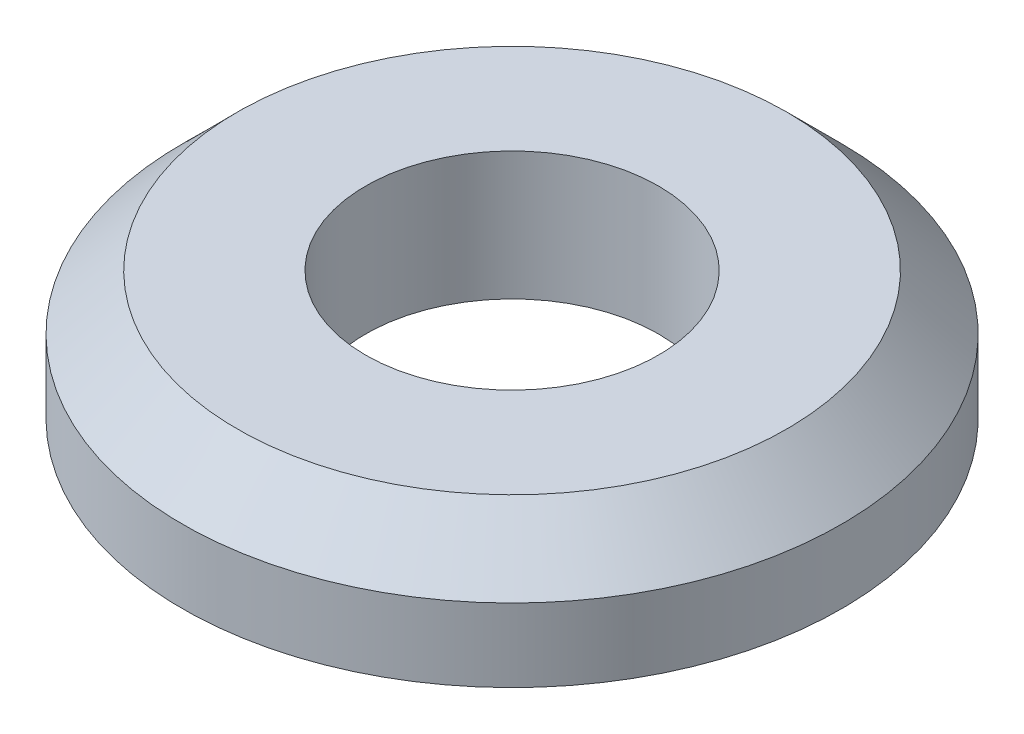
ISO-10303-21;
HEADER;
FILE_DESCRIPTION(('STEP AP214'),'2;1');
FILE_NAME('part.step','',(''),(''),'','','');
FILE_SCHEMA(('AUTOMOTIVE_DESIGN { 1 0 10303 214 1 1 1 1 }'));
ENDSEC;
DATA;
#1=APPLICATION_CONTEXT('core data for automotive mechanical design processes');
#2=APPLICATION_PROTOCOL_DEFINITION('international standard','automotive_design',2000,#1);
#3=PRODUCT_CONTEXT('',#1,'mechanical');
#4=PRODUCT('Part','Part','',(#3));
#5=PRODUCT_RELATED_PRODUCT_CATEGORY('part','',(#4));
#6=PRODUCT_DEFINITION_FORMATION('','',#4);
#7=PRODUCT_DEFINITION_CONTEXT('part definition',#1,'design');
#8=PRODUCT_DEFINITION('design','',#6,#7);
#9=PRODUCT_DEFINITION_SHAPE('','',#8);
#10=(LENGTH_UNIT() NAMED_UNIT(*) SI_UNIT(.MILLI.,.METRE.));
#11=(NAMED_UNIT(*) PLANE_ANGLE_UNIT() SI_UNIT($,.RADIAN.));
#12=(NAMED_UNIT(*) SI_UNIT($,.STERADIAN.) SOLID_ANGLE_UNIT());
#13=UNCERTAINTY_MEASURE_WITH_UNIT(LENGTH_MEASURE(1.E-05),#10,'distance_accuracy_value','');
#14=(GEOMETRIC_REPRESENTATION_CONTEXT(3) GLOBAL_UNCERTAINTY_ASSIGNED_CONTEXT((#13)) GLOBAL_UNIT_ASSIGNED_CONTEXT((#10,
#11,#12)) REPRESENTATION_CONTEXT('',''));
#15=CARTESIAN_POINT('',(0.,0.,0.));
#16=DIRECTION('',(0.,0.,1.));
#17=DIRECTION('',(1.,0.,0.));
#18=AXIS2_PLACEMENT_3D('',#15,#16,#17);
#19=CARTESIAN_POINT('',(0.,1.99999999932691,0.));
#20=DIRECTION('',(0.,-1.,0.));
#21=DIRECTION('',(0.,0.,-1.));
#22=AXIS2_PLACEMENT_3D('',#19,#20,#21);
#23=CONICAL_SURFACE('',#22,8.99999999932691,0.785398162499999);
#24=CARTESIAN_POINT('',(0.,3.50000000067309,0.));
#25=DIRECTION('',(0.,-1.,0.));
#26=DIRECTION('',(0.,0.,-1.));
#27=AXIS2_PLACEMENT_3D('',#24,#25,#26);
#28=CIRCLE('',#27,7.50000000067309);
#29=CARTESIAN_POINT('',(0.,3.50000000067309,-7.50000000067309));
#30=VERTEX_POINT('',#29);
#31=EDGE_CURVE('E17',#30,#30,#28,.F.);
#32=ORIENTED_EDGE('',*,*,#31,.F.);
#33=EDGE_LOOP('',(#32));
#34=FACE_BOUND('',#33,.T.);
#35=CARTESIAN_POINT('',(0.,2.,0.));
#36=DIRECTION('',(0.,-1.,0.));
#37=DIRECTION('',(0.,0.,-1.));
#38=AXIS2_PLACEMENT_3D('',#35,#36,#37);
#39=CIRCLE('',#38,9.);
#40=CARTESIAN_POINT('',(0.,2.,-9.));
#41=VERTEX_POINT('',#40);
#42=EDGE_CURVE('E32',#41,#41,#39,.T.);
#43=ORIENTED_EDGE('',*,*,#42,.F.);
#44=EDGE_LOOP('',(#43));
#45=FACE_BOUND('',#44,.T.);
#46=ADVANCED_FACE('F14',(#34,#45),#23,.T.);
#47=CARTESIAN_POINT('',(5.75,3.5,0.));
#48=DIRECTION('',(0.,1.,0.));
#49=DIRECTION('',(0.,0.,1.));
#50=AXIS2_PLACEMENT_3D('',#47,#48,#49);
#51=PLANE('',#50);
#52=CARTESIAN_POINT('',(0.,3.5,0.));
#53=DIRECTION('',(0.,-1.,0.));
#54=DIRECTION('',(0.,0.,-1.));
#55=AXIS2_PLACEMENT_3D('',#52,#53,#54);
#56=CIRCLE('',#55,4.);
#57=CARTESIAN_POINT('',(0.,3.5,-4.));
#58=VERTEX_POINT('',#57);
#59=EDGE_CURVE('E26',#58,#58,#56,.T.);
#60=ORIENTED_EDGE('',*,*,#59,.T.);
#61=EDGE_LOOP('',(#60));
#62=FACE_BOUND('',#61,.T.);
#63=ORIENTED_EDGE('',*,*,#31,.T.);
#64=EDGE_LOOP('',(#63));
#65=FACE_BOUND('',#64,.T.);
#66=ADVANCED_FACE('F41',(#62,#65),#51,.T.);
#67=CARTESIAN_POINT('',(0.,1.,0.));
#68=DIRECTION('',(0.,-1.,0.));
#69=DIRECTION('',(0.,0.,-1.));
#70=AXIS2_PLACEMENT_3D('',#67,#68,#69);
#71=CYLINDRICAL_SURFACE('',#70,9.);
#72=ORIENTED_EDGE('',*,*,#42,.T.);
#73=EDGE_LOOP('',(#72));
#74=FACE_BOUND('',#73,.T.);
#75=CARTESIAN_POINT('',(0.,0.,0.));
#76=DIRECTION('',(0.,-1.,0.));
#77=DIRECTION('',(0.,0.,-1.));
#78=AXIS2_PLACEMENT_3D('',#75,#76,#77);
#79=CIRCLE('',#78,9.);
#80=CARTESIAN_POINT('',(0.,0.,-9.));
#81=VERTEX_POINT('',#80);
#82=EDGE_CURVE('E21',#81,#81,#79,.T.);
#83=ORIENTED_EDGE('',*,*,#82,.F.);
#84=EDGE_LOOP('',(#83));
#85=FACE_BOUND('',#84,.T.);
#86=ADVANCED_FACE('F49',(#74,#85),#71,.T.);
#87=CARTESIAN_POINT('',(0.,1.75,0.));
#88=DIRECTION('',(0.,-1.,0.));
#89=DIRECTION('',(0.,0.,-1.));
#90=AXIS2_PLACEMENT_3D('',#87,#88,#89);
#91=CYLINDRICAL_SURFACE('',#90,4.);
#92=CARTESIAN_POINT('',(0.,0.,0.));
#93=DIRECTION('',(0.,-1.,0.));
#94=DIRECTION('',(0.,0.,-1.));
#95=AXIS2_PLACEMENT_3D('',#92,#93,#94);
#96=CIRCLE('',#95,4.);
#97=CARTESIAN_POINT('',(0.,0.,-4.));
#98=VERTEX_POINT('',#97);
#99=EDGE_CURVE('E10',#98,#98,#96,.F.);
#100=ORIENTED_EDGE('',*,*,#99,.F.);
#101=EDGE_LOOP('',(#100));
#102=FACE_BOUND('',#101,.T.);
#103=ORIENTED_EDGE('',*,*,#59,.F.);
#104=EDGE_LOOP('',(#103));
#105=FACE_BOUND('',#104,.T.);
#106=ADVANCED_FACE('F52',(#102,#105),#91,.F.);
#107=CARTESIAN_POINT('',(6.5,0.,0.));
#108=DIRECTION('',(0.,-1.,0.));
#109=DIRECTION('',(0.,0.,-1.));
#110=AXIS2_PLACEMENT_3D('',#107,#108,#109);
#111=PLANE('',#110);
#112=ORIENTED_EDGE('',*,*,#99,.T.);
#113=EDGE_LOOP('',(#112));
#114=FACE_BOUND('',#113,.T.);
#115=ORIENTED_EDGE('',*,*,#82,.T.);
#116=EDGE_LOOP('',(#115));
#117=FACE_BOUND('',#116,.T.);
#118=ADVANCED_FACE('F50',(#114,#117),#111,.T.);
#119=CLOSED_SHELL('',(#46,#66,#86,#106,#118));
#120=MANIFOLD_SOLID_BREP('B1',#119);
#121=ADVANCED_BREP_SHAPE_REPRESENTATION('',(#18,#120),#14);
#122=SHAPE_DEFINITION_REPRESENTATION(#9,#121);
ENDSEC;
END-ISO-10303-21;
